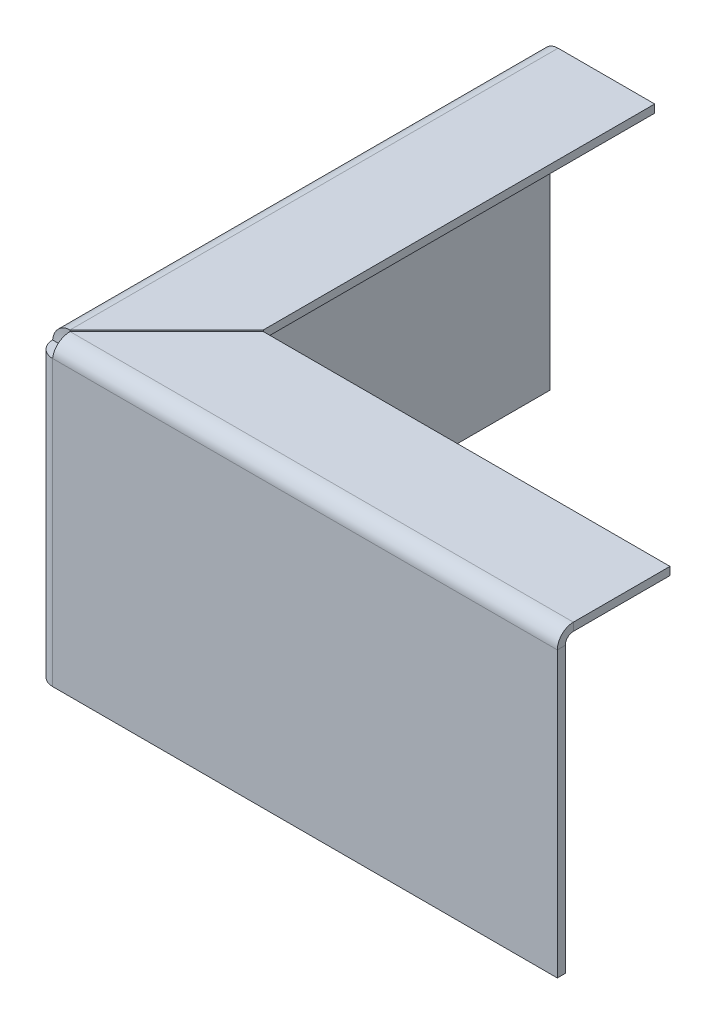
ISO-10303-21;
HEADER;
FILE_DESCRIPTION(('STEP AP214'),'2;1');
FILE_NAME('part.step','',(''),(''),'','','');
FILE_SCHEMA(('AUTOMOTIVE_DESIGN { 1 0 10303 214 1 1 1 1 }'));
ENDSEC;
DATA;
#1=APPLICATION_CONTEXT('core data for automotive mechanical design processes');
#2=APPLICATION_PROTOCOL_DEFINITION('international standard','automotive_design',2000,#1);
#3=PRODUCT_CONTEXT('',#1,'mechanical');
#4=PRODUCT('Part','Part','',(#3));
#5=PRODUCT_RELATED_PRODUCT_CATEGORY('part','',(#4));
#6=PRODUCT_DEFINITION_FORMATION('','',#4);
#7=PRODUCT_DEFINITION_CONTEXT('part definition',#1,'design');
#8=PRODUCT_DEFINITION('design','',#6,#7);
#9=PRODUCT_DEFINITION_SHAPE('','',#8);
#10=(LENGTH_UNIT() NAMED_UNIT(*) SI_UNIT(.MILLI.,.METRE.));
#11=(NAMED_UNIT(*) PLANE_ANGLE_UNIT() SI_UNIT($,.RADIAN.));
#12=(NAMED_UNIT(*) SI_UNIT($,.STERADIAN.) SOLID_ANGLE_UNIT());
#13=UNCERTAINTY_MEASURE_WITH_UNIT(LENGTH_MEASURE(1.E-05),#10,'distance_accuracy_value','');
#14=(GEOMETRIC_REPRESENTATION_CONTEXT(3) GLOBAL_UNCERTAINTY_ASSIGNED_CONTEXT((#13)) GLOBAL_UNIT_ASSIGNED_CONTEXT((#10,
#11,#12)) REPRESENTATION_CONTEXT('',''));
#15=CARTESIAN_POINT('',(0.,0.,0.));
#16=DIRECTION('',(0.,0.,1.));
#17=DIRECTION('',(1.,0.,0.));
#18=AXIS2_PLACEMENT_3D('',#15,#16,#17);
#19=CARTESIAN_POINT('',(0.,37.5,0.));
#20=DIRECTION('',(0.,0.,-1.));
#21=DIRECTION('',(-1.,0.,0.));
#22=AXIS2_PLACEMENT_3D('',#19,#20,#21);
#23=PLANE('',#22);
#24=DIRECTION('',(-1.,0.,0.));
#25=VECTOR('',#24,1.);
#26=CARTESIAN_POINT('',(380.322506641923,35.5000000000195,0.));
#27=LINE('',#26,#25);
#28=CARTESIAN_POINT('',(65.0537511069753,35.5000000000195,0.));
#29=VERTEX_POINT('',#28);
#30=CARTESIAN_POINT('',(2.,35.5000000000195,0.));
#31=VERTEX_POINT('',#30);
#32=EDGE_CURVE('E226',#29,#31,#27,.T.);
#33=ORIENTED_EDGE('',*,*,#32,.T.);
#34=DIRECTION('',(0.,-1.,0.));
#35=VECTOR('',#34,1.);
#36=CARTESIAN_POINT('',(2.,37.5,0.));
#37=LINE('',#36,#35);
#38=CARTESIAN_POINT('',(2.,0.,0.));
#39=VERTEX_POINT('',#38);
#40=EDGE_CURVE('E50',#31,#39,#37,.T.);
#41=ORIENTED_EDGE('',*,*,#40,.T.);
#42=DIRECTION('',(1.,0.,0.));
#43=VECTOR('',#42,1.);
#44=CARTESIAN_POINT('',(0.,0.,0.));
#45=LINE('',#44,#43);
#46=CARTESIAN_POINT('',(65.05375110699,0.,0.));
#47=VERTEX_POINT('',#46);
#48=EDGE_CURVE('E280',#39,#47,#45,.T.);
#49=ORIENTED_EDGE('',*,*,#48,.T.);
#50=DIRECTION('',(0.,-1.,0.));
#51=VECTOR('',#50,1.);
#52=CARTESIAN_POINT('',(65.05375110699,37.5,0.));
#53=LINE('',#52,#51);
#54=EDGE_CURVE('E311',#29,#47,#53,.T.);
#55=ORIENTED_EDGE('',*,*,#54,.F.);
#56=EDGE_LOOP('',(#33,#41,#49,#55));
#57=FACE_BOUND('',#56,.T.);
#58=ADVANCED_FACE('F35',(#57),#23,.F.);
#59=CARTESIAN_POINT('',(65.05375110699,37.5,-1.));
#60=DIRECTION('',(1.,0.,0.));
#61=DIRECTION('',(0.,0.,-1.));
#62=AXIS2_PLACEMENT_3D('',#59,#60,#61);
#63=PLANE('',#62);
#64=DIRECTION('',(0.,-1.,0.));
#65=VECTOR('',#64,1.);
#66=CARTESIAN_POINT('',(65.05375110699,37.5,-1.));
#67=LINE('',#66,#65);
#68=CARTESIAN_POINT('',(65.05375110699,35.5000000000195,-1.));
#69=VERTEX_POINT('',#68);
#70=CARTESIAN_POINT('',(65.05375110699,0.,-1.));
#71=VERTEX_POINT('',#70);
#72=EDGE_CURVE('E309',#69,#71,#67,.T.);
#73=ORIENTED_EDGE('',*,*,#72,.F.);
#74=DIRECTION('',(0.,0.,-1.));
#75=VECTOR('',#74,1.);
#76=CARTESIAN_POINT('',(65.0537511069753,35.5000000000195,0.));
#77=LINE('',#76,#75);
#78=EDGE_CURVE('E245',#29,#69,#77,.T.);
#79=ORIENTED_EDGE('',*,*,#78,.F.);
#80=ORIENTED_EDGE('',*,*,#54,.T.);
#81=DIRECTION('',(0.,0.,1.));
#82=VECTOR('',#81,1.);
#83=CARTESIAN_POINT('',(65.05375110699,0.,-1.));
#84=LINE('',#83,#82);
#85=EDGE_CURVE('E283',#71,#47,#84,.T.);
#86=ORIENTED_EDGE('',*,*,#85,.F.);
#87=EDGE_LOOP('',(#73,#79,#80,#86));
#88=FACE_BOUND('',#87,.T.);
#89=ADVANCED_FACE('F333',(#88),#63,.T.);
#90=CARTESIAN_POINT('',(0.,37.5,-1.));
#91=DIRECTION('',(0.,0.,-1.));
#92=DIRECTION('',(-1.,0.,0.));
#93=AXIS2_PLACEMENT_3D('',#90,#91,#92);
#94=PLANE('',#93);
#95=DIRECTION('',(0.,-1.,0.));
#96=VECTOR('',#95,1.);
#97=CARTESIAN_POINT('',(2.,37.5,-1.));
#98=LINE('',#97,#96);
#99=CARTESIAN_POINT('',(2.,35.5000000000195,-1.));
#100=VERTEX_POINT('',#99);
#101=CARTESIAN_POINT('',(2.,0.,-1.));
#102=VERTEX_POINT('',#101);
#103=EDGE_CURVE('E307',#100,#102,#98,.T.);
#104=ORIENTED_EDGE('',*,*,#103,.F.);
#105=DIRECTION('',(-1.,0.,0.));
#106=VECTOR('',#105,1.);
#107=CARTESIAN_POINT('',(380.322506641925,35.5000000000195,-1.));
#108=LINE('',#107,#106);
#109=EDGE_CURVE('E228',#69,#100,#108,.T.);
#110=ORIENTED_EDGE('',*,*,#109,.F.);
#111=ORIENTED_EDGE('',*,*,#72,.T.);
#112=DIRECTION('',(1.,0.,0.));
#113=VECTOR('',#112,1.);
#114=CARTESIAN_POINT('',(0.,0.,-1.));
#115=LINE('',#114,#113);
#116=EDGE_CURVE('E286',#102,#71,#115,.T.);
#117=ORIENTED_EDGE('',*,*,#116,.F.);
#118=EDGE_LOOP('',(#104,#110,#111,#117));
#119=FACE_BOUND('',#118,.T.);
#120=ADVANCED_FACE('F328',(#119),#94,.T.);
#121=CARTESIAN_POINT('',(2.,37.5,-2.));
#122=DIRECTION('',(0.,-1.,0.));
#123=DIRECTION('',(0.,0.,-1.));
#124=AXIS2_PLACEMENT_3D('',#121,#122,#123);
#125=CYLINDRICAL_SURFACE('',#124,1.);
#126=DIRECTION('',(0.,-1.,0.));
#127=VECTOR('',#126,1.);
#128=CARTESIAN_POINT('',(1.,37.5,-2.));
#129=LINE('',#128,#127);
#130=CARTESIAN_POINT('',(1.,35.5000000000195,-2.));
#131=VERTEX_POINT('',#130);
#132=CARTESIAN_POINT('',(1.,0.,-2.));
#133=VERTEX_POINT('',#132);
#134=EDGE_CURVE('E305',#131,#133,#129,.T.);
#135=ORIENTED_EDGE('',*,*,#134,.F.);
#136=CARTESIAN_POINT('',(2.,35.5000000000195,-2.));
#137=DIRECTION('',(0.,1.,0.));
#138=DIRECTION('',(0.,0.,1.));
#139=AXIS2_PLACEMENT_3D('',#136,#137,#138);
#140=CIRCLE('',#139,1.);
#141=EDGE_CURVE('E164',#131,#100,#140,.T.);
#142=ORIENTED_EDGE('',*,*,#141,.T.);
#143=ORIENTED_EDGE('',*,*,#103,.T.);
#144=CARTESIAN_POINT('',(2.,0.,-2.));
#145=DIRECTION('',(0.,1.,0.));
#146=DIRECTION('',(1.,0.,0.));
#147=AXIS2_PLACEMENT_3D('',#144,#145,#146);
#148=CIRCLE('',#147,1.);
#149=EDGE_CURVE('E289',#133,#102,#148,.T.);
#150=ORIENTED_EDGE('',*,*,#149,.F.);
#151=EDGE_LOOP('',(#135,#142,#143,#150));
#152=FACE_BOUND('',#151,.T.);
#153=ADVANCED_FACE('F321',(#152),#125,.F.);
#154=CARTESIAN_POINT('',(1.,37.5,0.));
#155=DIRECTION('',(1.,0.,0.));
#156=DIRECTION('',(0.,0.,-1.));
#157=AXIS2_PLACEMENT_3D('',#154,#155,#156);
#158=PLANE('',#157);
#159=DIRECTION('',(0.,-1.,0.));
#160=VECTOR('',#159,1.);
#161=CARTESIAN_POINT('',(1.,37.5,-63.1465712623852));
#162=LINE('',#161,#160);
#163=CARTESIAN_POINT('',(1.,35.5000000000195,-63.1465712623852));
#164=VERTEX_POINT('',#163);
#165=CARTESIAN_POINT('',(1.,0.,-63.1465712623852));
#166=VERTEX_POINT('',#165);
#167=EDGE_CURVE('E303',#164,#166,#162,.T.);
#168=ORIENTED_EDGE('',*,*,#167,.F.);
#169=DIRECTION('',(0.,0.,-1.));
#170=VECTOR('',#169,1.);
#171=CARTESIAN_POINT('',(1.,35.5000000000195,-2.00000000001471));
#172=LINE('',#171,#170);
#173=EDGE_CURVE('E192',#131,#164,#172,.T.);
#174=ORIENTED_EDGE('',*,*,#173,.F.);
#175=ORIENTED_EDGE('',*,*,#134,.T.);
#176=DIRECTION('',(0.,0.,-1.));
#177=VECTOR('',#176,1.);
#178=CARTESIAN_POINT('',(1.,0.,0.));
#179=LINE('',#178,#177);
#180=EDGE_CURVE('E292',#166,#133,#179,.F.);
#181=ORIENTED_EDGE('',*,*,#180,.F.);
#182=EDGE_LOOP('',(#168,#174,#175,#181));
#183=FACE_BOUND('',#182,.T.);
#184=ADVANCED_FACE('F361',(#183),#158,.T.);
#185=CARTESIAN_POINT('',(0.,37.5,-63.1465712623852));
#186=DIRECTION('',(0.,0.,-1.));
#187=DIRECTION('',(-1.,0.,0.));
#188=AXIS2_PLACEMENT_3D('',#185,#186,#187);
#189=PLANE('',#188);
#190=DIRECTION('',(0.,-1.,0.));
#191=VECTOR('',#190,1.);
#192=CARTESIAN_POINT('',(0.,37.5,-63.1465712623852));
#193=LINE('',#192,#191);
#194=CARTESIAN_POINT('',(0.,35.5000000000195,-63.1465712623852));
#195=VERTEX_POINT('',#194);
#196=CARTESIAN_POINT('',(0.,0.,-63.1465712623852));
#197=VERTEX_POINT('',#196);
#198=EDGE_CURVE('E157',#195,#197,#193,.T.);
#199=ORIENTED_EDGE('',*,*,#198,.F.);
#200=DIRECTION('',(1.,0.,0.));
#201=VECTOR('',#200,1.);
#202=CARTESIAN_POINT('',(-8.57657896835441E-13,35.5000000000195,-63.1465712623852));
#203=LINE('',#202,#201);
#204=EDGE_CURVE('E177',#195,#164,#203,.T.);
#205=ORIENTED_EDGE('',*,*,#204,.T.);
#206=ORIENTED_EDGE('',*,*,#167,.T.);
#207=DIRECTION('',(1.,0.,0.));
#208=VECTOR('',#207,1.);
#209=CARTESIAN_POINT('',(0.,0.,-63.1465712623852));
#210=LINE('',#209,#208);
#211=EDGE_CURVE('E295',#197,#166,#210,.T.);
#212=ORIENTED_EDGE('',*,*,#211,.F.);
#213=EDGE_LOOP('',(#199,#205,#206,#212));
#214=FACE_BOUND('',#213,.T.);
#215=ADVANCED_FACE('F355',(#214),#189,.T.);
#216=CARTESIAN_POINT('',(0.,37.5,0.));
#217=DIRECTION('',(1.,0.,0.));
#218=DIRECTION('',(0.,0.,-1.));
#219=AXIS2_PLACEMENT_3D('',#216,#217,#218);
#220=PLANE('',#219);
#221=DIRECTION('',(0.,0.,-1.));
#222=VECTOR('',#221,1.);
#223=CARTESIAN_POINT('',(0.,35.5000000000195,-2.00000000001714));
#224=LINE('',#223,#222);
#225=CARTESIAN_POINT('',(0.,35.5000000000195,-2.00000000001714));
#226=VERTEX_POINT('',#225);
#227=EDGE_CURVE('E152',#226,#195,#224,.T.);
#228=ORIENTED_EDGE('',*,*,#227,.T.);
#229=ORIENTED_EDGE('',*,*,#198,.T.);
#230=DIRECTION('',(0.,0.,1.));
#231=VECTOR('',#230,1.);
#232=CARTESIAN_POINT('',(0.,0.,0.));
#233=LINE('',#232,#231);
#234=CARTESIAN_POINT('',(0.,0.,-2.));
#235=VERTEX_POINT('',#234);
#236=EDGE_CURVE('E155',#197,#235,#233,.T.);
#237=ORIENTED_EDGE('',*,*,#236,.T.);
#238=DIRECTION('',(0.,-1.,0.));
#239=VECTOR('',#238,1.);
#240=CARTESIAN_POINT('',(0.,37.5,-2.));
#241=LINE('',#240,#239);
#242=EDGE_CURVE('E58',#226,#235,#241,.T.);
#243=ORIENTED_EDGE('',*,*,#242,.F.);
#244=EDGE_LOOP('',(#228,#229,#237,#243));
#245=FACE_BOUND('',#244,.T.);
#246=ADVANCED_FACE('F150',(#245),#220,.F.);
#247=CARTESIAN_POINT('',(2.,37.5,-2.));
#248=DIRECTION('',(0.,-1.,0.));
#249=DIRECTION('',(0.,0.,-1.));
#250=AXIS2_PLACEMENT_3D('',#247,#248,#249);
#251=CYLINDRICAL_SURFACE('',#250,2.);
#252=CARTESIAN_POINT('',(2.,35.5000000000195,-2.));
#253=DIRECTION('',(0.,-1.,0.));
#254=DIRECTION('',(0.,0.,-1.));
#255=AXIS2_PLACEMENT_3D('',#252,#253,#254);
#256=CIRCLE('',#255,2.);
#257=EDGE_CURVE('E159',#226,#31,#256,.F.);
#258=ORIENTED_EDGE('',*,*,#257,.F.);
#259=ORIENTED_EDGE('',*,*,#242,.T.);
#260=CARTESIAN_POINT('',(2.,0.,-2.));
#261=DIRECTION('',(0.,-1.,0.));
#262=DIRECTION('',(0.,0.,-1.));
#263=AXIS2_PLACEMENT_3D('',#260,#261,#262);
#264=CIRCLE('',#263,2.);
#265=EDGE_CURVE('E299',#235,#39,#264,.F.);
#266=ORIENTED_EDGE('',*,*,#265,.T.);
#267=ORIENTED_EDGE('',*,*,#40,.F.);
#268=EDGE_LOOP('',(#258,#259,#266,#267));
#269=FACE_BOUND('',#268,.T.);
#270=ADVANCED_FACE('F161',(#269),#251,.T.);
#271=CARTESIAN_POINT('',(2.,0.,0.));
#272=DIRECTION('',(0.,-1.,0.));
#273=DIRECTION('',(0.,0.,-1.));
#274=AXIS2_PLACEMENT_3D('',#271,#272,#273);
#275=PLANE('',#274);
#276=DIRECTION('',(0.,0.,-1.));
#277=VECTOR('',#276,1.);
#278=CARTESIAN_POINT('',(2.,0.,0.));
#279=LINE('',#278,#277);
#280=EDGE_CURVE('E11',#39,#102,#279,.T.);
#281=ORIENTED_EDGE('',*,*,#280,.F.);
#282=ORIENTED_EDGE('',*,*,#265,.F.);
#283=DIRECTION('',(-1.,0.,0.));
#284=VECTOR('',#283,1.);
#285=CARTESIAN_POINT('',(1.,0.,-2.));
#286=LINE('',#285,#284);
#287=EDGE_CURVE('E43',#133,#235,#286,.T.);
#288=ORIENTED_EDGE('',*,*,#287,.F.);
#289=ORIENTED_EDGE('',*,*,#149,.T.);
#290=EDGE_LOOP('',(#281,#282,#288,#289));
#291=FACE_BOUND('',#290,.T.);
#292=ADVANCED_FACE('F37',(#291),#275,.T.);
#293=CARTESIAN_POINT('',(1.,0.,-2.));
#294=DIRECTION('',(0.,-1.,0.));
#295=DIRECTION('',(0.,0.,-1.));
#296=AXIS2_PLACEMENT_3D('',#293,#294,#295);
#297=PLANE('',#296);
#298=ORIENTED_EDGE('',*,*,#48,.F.);
#299=ORIENTED_EDGE('',*,*,#280,.T.);
#300=ORIENTED_EDGE('',*,*,#116,.T.);
#301=ORIENTED_EDGE('',*,*,#85,.T.);
#302=EDGE_LOOP('',(#298,#299,#300,#301));
#303=FACE_BOUND('',#302,.T.);
#304=ADVANCED_FACE('F327',(#303),#297,.T.);
#305=CARTESIAN_POINT('',(2.,0.,-2.));
#306=DIRECTION('',(0.,1.,0.));
#307=DIRECTION('',(0.,0.,1.));
#308=AXIS2_PLACEMENT_3D('',#305,#306,#307);
#309=PLANE('',#308);
#310=ORIENTED_EDGE('',*,*,#180,.T.);
#311=ORIENTED_EDGE('',*,*,#287,.T.);
#312=ORIENTED_EDGE('',*,*,#236,.F.);
#313=ORIENTED_EDGE('',*,*,#211,.T.);
#314=EDGE_LOOP('',(#310,#311,#312,#313));
#315=FACE_BOUND('',#314,.T.);
#316=ADVANCED_FACE('F314',(#315),#309,.F.);
#317=CARTESIAN_POINT('',(2.,35.5000000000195,-2.));
#318=DIRECTION('',(0.,1.,0.));
#319=DIRECTION('',(0.,0.,1.));
#320=AXIS2_PLACEMENT_3D('',#317,#318,#319);
#321=PLANE('',#320);
#322=DIRECTION('',(1.,0.,0.));
#323=VECTOR('',#322,1.);
#324=CARTESIAN_POINT('',(0.,35.5000000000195,-2.00000000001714));
#325=LINE('',#324,#323);
#326=EDGE_CURVE('E168',#226,#131,#325,.T.);
#327=ORIENTED_EDGE('',*,*,#326,.F.);
#328=ORIENTED_EDGE('',*,*,#257,.T.);
#329=DIRECTION('',(0.,0.,-1.));
#330=VECTOR('',#329,1.);
#331=CARTESIAN_POINT('',(2.,35.5000000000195,0.));
#332=LINE('',#331,#330);
#333=EDGE_CURVE('E238',#31,#100,#332,.T.);
#334=ORIENTED_EDGE('',*,*,#333,.T.);
#335=ORIENTED_EDGE('',*,*,#141,.F.);
#336=EDGE_LOOP('',(#327,#328,#334,#335));
#337=FACE_BOUND('',#336,.T.);
#338=ADVANCED_FACE('F169',(#337),#321,.T.);
#339=CARTESIAN_POINT('',(65.05375110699,37.5,-14.071220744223));
#340=DIRECTION('',(0.,-1.61498976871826E-12,-1.));
#341=DIRECTION('',(1.,0.,0.));
#342=AXIS2_PLACEMENT_3D('',#339,#340,#341);
#343=PLANE('',#342);
#344=DIRECTION('',(0.,-1.,1.61498976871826E-12));
#345=VECTOR('',#344,1.);
#346=CARTESIAN_POINT('',(14.2479974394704,37.5,-14.071220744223));
#347=LINE('',#346,#345);
#348=CARTESIAN_POINT('',(14.2479974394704,37.5,-14.071220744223));
#349=VERTEX_POINT('',#348);
#350=CARTESIAN_POINT('',(14.2479974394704,36.5,-14.0712207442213));
#351=VERTEX_POINT('',#350);
#352=EDGE_CURVE('E165',#349,#351,#347,.T.);
#353=ORIENTED_EDGE('',*,*,#352,.F.);
#354=DIRECTION('',(1.,0.,0.));
#355=VECTOR('',#354,1.);
#356=CARTESIAN_POINT('',(65.05375110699,37.5,-14.071220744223));
#357=LINE('',#356,#355);
#358=CARTESIAN_POINT('',(65.05375110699,37.5,-14.071220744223));
#359=VERTEX_POINT('',#358);
#360=EDGE_CURVE('E248',#359,#349,#357,.F.);
#361=ORIENTED_EDGE('',*,*,#360,.F.);
#362=DIRECTION('',(0.,-1.,1.61498976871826E-12));
#363=VECTOR('',#362,1.);
#364=CARTESIAN_POINT('',(65.05375110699,37.5,-14.071220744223));
#365=LINE('',#364,#363);
#366=CARTESIAN_POINT('',(65.05375110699,36.5,-14.0712207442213));
#367=VERTEX_POINT('',#366);
#368=EDGE_CURVE('E275',#359,#367,#365,.T.);
#369=ORIENTED_EDGE('',*,*,#368,.T.);
#370=DIRECTION('',(1.,0.,0.));
#371=VECTOR('',#370,1.);
#372=CARTESIAN_POINT('',(65.05375110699,36.5,-14.0712207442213));
#373=LINE('',#372,#371);
#374=EDGE_CURVE('E256',#367,#351,#373,.F.);
#375=ORIENTED_EDGE('',*,*,#374,.T.);
#376=EDGE_LOOP('',(#353,#361,#369,#375));
#377=FACE_BOUND('',#376,.T.);
#378=ADVANCED_FACE('F402',(#377),#343,.T.);
#379=CARTESIAN_POINT('',(65.05375110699,37.5,-14.071220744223));
#380=DIRECTION('',(-1.,0.,0.));
#381=DIRECTION('',(0.,-1.61498976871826E-12,-1.));
#382=AXIS2_PLACEMENT_3D('',#379,#380,#381);
#383=PLANE('',#382);
#384=ORIENTED_EDGE('',*,*,#368,.F.);
#385=DIRECTION('',(0.,-1.61498976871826E-12,-1.));
#386=VECTOR('',#385,1.);
#387=CARTESIAN_POINT('',(65.05375110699,37.5,-14.071220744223));
#388=LINE('',#387,#386);
#389=CARTESIAN_POINT('',(65.0537511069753,37.5000000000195,-2.00000000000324));
#390=VERTEX_POINT('',#389);
#391=EDGE_CURVE('E266',#359,#390,#388,.F.);
#392=ORIENTED_EDGE('',*,*,#391,.T.);
#393=DIRECTION('',(0.,-1.,1.61498976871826E-12));
#394=VECTOR('',#393,1.);
#395=CARTESIAN_POINT('',(65.0537511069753,37.5000000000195,-2.00000000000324));
#396=LINE('',#395,#394);
#397=CARTESIAN_POINT('',(65.0537511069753,36.5000000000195,-2.00000000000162));
#398=VERTEX_POINT('',#397);
#399=EDGE_CURVE('E273',#390,#398,#396,.T.);
#400=ORIENTED_EDGE('',*,*,#399,.T.);
#401=DIRECTION('',(0.,-1.61498976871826E-12,-1.));
#402=VECTOR('',#401,1.);
#403=CARTESIAN_POINT('',(65.05375110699,36.5,-14.0712207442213));
#404=LINE('',#403,#402);
#405=EDGE_CURVE('E253',#367,#398,#404,.F.);
#406=ORIENTED_EDGE('',*,*,#405,.F.);
#407=EDGE_LOOP('',(#384,#392,#400,#406));
#408=FACE_BOUND('',#407,.T.);
#409=ADVANCED_FACE('F412',(#408),#383,.F.);
#410=CARTESIAN_POINT('',(39.6508742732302,37.499999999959,-39.4740975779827));
#411=DIRECTION('',(-0.707106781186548,-1.14197021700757E-12,-0.707106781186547));
#412=DIRECTION('',(0.707106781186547,-1.14197021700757E-12,-0.707106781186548));
#413=AXIS2_PLACEMENT_3D('',#410,#411,#412);
#414=PLANE('',#413);
#415=DIRECTION('',(0.707106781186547,-1.14197021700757E-12,-0.707106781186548));
#416=VECTOR('',#415,1.);
#417=CARTESIAN_POINT('',(39.6508742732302,37.499999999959,-39.4740975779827));
#418=LINE('',#417,#416);
#419=CARTESIAN_POINT('',(2.17677669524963,37.5000000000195,-2.00000000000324));
#420=VERTEX_POINT('',#419);
#421=EDGE_CURVE('E259',#420,#349,#418,.T.);
#422=ORIENTED_EDGE('',*,*,#421,.T.);
#423=ORIENTED_EDGE('',*,*,#352,.T.);
#424=DIRECTION('',(0.707106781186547,-1.14197021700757E-12,-0.707106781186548));
#425=VECTOR('',#424,1.);
#426=CARTESIAN_POINT('',(39.6508742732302,36.499999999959,-39.4740975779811));
#427=LINE('',#426,#425);
#428=CARTESIAN_POINT('',(2.17677669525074,36.5000000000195,-2.00000000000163));
#429=VERTEX_POINT('',#428);
#430=EDGE_CURVE('E252',#429,#351,#427,.T.);
#431=ORIENTED_EDGE('',*,*,#430,.F.);
#432=DIRECTION('',(0.,-1.,1.61498976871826E-12));
#433=VECTOR('',#432,1.);
#434=CARTESIAN_POINT('',(2.17677669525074,37.5000000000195,-2.00000000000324));
#435=LINE('',#434,#433);
#436=EDGE_CURVE('E262',#420,#429,#435,.T.);
#437=ORIENTED_EDGE('',*,*,#436,.F.);
#438=EDGE_LOOP('',(#422,#423,#431,#437));
#439=FACE_BOUND('',#438,.T.);
#440=ADVANCED_FACE('F424',(#439),#414,.T.);
#441=CARTESIAN_POINT('',(65.05375110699,36.5,-14.0712207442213));
#442=DIRECTION('',(0.,-1.,1.61498976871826E-12));
#443=DIRECTION('',(0.,-1.61498976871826E-12,-1.));
#444=AXIS2_PLACEMENT_3D('',#441,#442,#443);
#445=PLANE('',#444);
#446=DIRECTION('',(1.,0.,0.));
#447=VECTOR('',#446,1.);
#448=CARTESIAN_POINT('',(65.05375110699,36.5000000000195,-2.00000000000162));
#449=LINE('',#448,#447);
#450=EDGE_CURVE('E250',#398,#429,#449,.F.);
#451=ORIENTED_EDGE('',*,*,#450,.T.);
#452=ORIENTED_EDGE('',*,*,#430,.T.);
#453=ORIENTED_EDGE('',*,*,#374,.F.);
#454=ORIENTED_EDGE('',*,*,#405,.T.);
#455=EDGE_LOOP('',(#451,#452,#453,#454));
#456=FACE_BOUND('',#455,.T.);
#457=ADVANCED_FACE('F427',(#456),#445,.T.);
#458=CARTESIAN_POINT('',(65.05375110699,37.5,-14.071220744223));
#459=DIRECTION('',(0.,-1.,1.61498976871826E-12));
#460=DIRECTION('',(0.,-1.61498976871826E-12,-1.));
#461=AXIS2_PLACEMENT_3D('',#458,#459,#460);
#462=PLANE('',#461);
#463=DIRECTION('',(1.,0.,0.));
#464=VECTOR('',#463,1.);
#465=CARTESIAN_POINT('',(65.05375110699,37.5000000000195,-2.00000000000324));
#466=LINE('',#465,#464);
#467=EDGE_CURVE('E263',#390,#420,#466,.F.);
#468=ORIENTED_EDGE('',*,*,#467,.F.);
#469=ORIENTED_EDGE('',*,*,#391,.F.);
#470=ORIENTED_EDGE('',*,*,#360,.T.);
#471=ORIENTED_EDGE('',*,*,#421,.F.);
#472=EDGE_LOOP('',(#468,#469,#470,#471));
#473=FACE_BOUND('',#472,.T.);
#474=ADVANCED_FACE('F438',(#473),#462,.F.);
#475=CARTESIAN_POINT('',(65.0537511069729,35.5000000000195,-2.));
#476=DIRECTION('',(-1.,1.22124532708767E-12,0.));
#477=DIRECTION('',(-1.22124532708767E-12,-1.,0.));
#478=AXIS2_PLACEMENT_3D('',#475,#476,#477);
#479=PLANE('',#478);
#480=ORIENTED_EDGE('',*,*,#399,.F.);
#481=CARTESIAN_POINT('',(65.0537511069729,35.5000000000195,-2.));
#482=DIRECTION('',(1.,-1.22124532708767E-12,0.));
#483=DIRECTION('',(1.22124532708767E-12,1.,0.));
#484=AXIS2_PLACEMENT_3D('',#481,#482,#483);
#485=CIRCLE('',#484,2.);
#486=EDGE_CURVE('E240',#390,#29,#485,.T.);
#487=ORIENTED_EDGE('',*,*,#486,.T.);
#488=ORIENTED_EDGE('',*,*,#78,.T.);
#489=CARTESIAN_POINT('',(65.0537511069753,35.5000000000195,-2.));
#490=DIRECTION('',(-1.,0.,0.));
#491=DIRECTION('',(0.,0.,1.));
#492=AXIS2_PLACEMENT_3D('',#489,#490,#491);
#493=CIRCLE('',#492,1.);
#494=EDGE_CURVE('E231',#398,#69,#493,.F.);
#495=ORIENTED_EDGE('',*,*,#494,.F.);
#496=EDGE_LOOP('',(#480,#487,#488,#495));
#497=FACE_BOUND('',#496,.T.);
#498=ADVANCED_FACE('F457',(#497),#479,.F.);
#499=CARTESIAN_POINT('',(1.82322330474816,34.5000000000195,-2.));
#500=CARTESIAN_POINT('',(1.82322330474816,34.1666666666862,-2.));
#501=CARTESIAN_POINT('',(1.82322330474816,33.8333333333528,-2.));
#502=CARTESIAN_POINT('',(1.82322330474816,33.5000000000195,-2.));
#503=CARTESIAN_POINT('',(1.82322330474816,34.5000000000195,0.));
#504=CARTESIAN_POINT('',(1.82322330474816,34.1666666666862,0.666666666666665));
#505=CARTESIAN_POINT('',(1.82322330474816,33.8333333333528,1.33333333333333));
#506=CARTESIAN_POINT('',(1.82322330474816,33.5000000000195,2.));
#507=CARTESIAN_POINT('',(2.17677669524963,36.5000000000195,0.));
#508=CARTESIAN_POINT('',(2.17677669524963,36.8333333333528,0.666666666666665));
#509=CARTESIAN_POINT('',(2.17677669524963,37.1666666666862,1.33333333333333));
#510=CARTESIAN_POINT('',(2.17677669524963,37.5000000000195,2.));
#511=CARTESIAN_POINT('',(2.17677669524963,36.5000000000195,-2.));
#512=CARTESIAN_POINT('',(2.17677669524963,36.8333333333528,-2.));
#513=CARTESIAN_POINT('',(2.17677669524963,37.1666666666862,-2.));
#514=CARTESIAN_POINT('',(2.17677669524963,37.5000000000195,-2.));
#515=CARTESIAN_POINT('',(2.17677669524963,36.5000000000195,-4.));
#516=CARTESIAN_POINT('',(2.17677669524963,36.8333333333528,-4.66666666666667));
#517=CARTESIAN_POINT('',(2.17677669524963,37.1666666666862,-5.33333333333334));
#518=CARTESIAN_POINT('',(2.17677669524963,37.5000000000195,-6.));
#519=CARTESIAN_POINT('',(1.82322330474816,34.5000000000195,-4.));
#520=CARTESIAN_POINT('',(1.82322330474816,34.1666666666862,-4.66666666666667));
#521=CARTESIAN_POINT('',(1.82322330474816,33.8333333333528,-5.33333333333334));
#522=CARTESIAN_POINT('',(1.82322330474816,33.5000000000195,-6.));
#523=CARTESIAN_POINT('',(1.82322330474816,34.5000000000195,-2.));
#524=CARTESIAN_POINT('',(1.82322330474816,34.1666666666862,-2.));
#525=CARTESIAN_POINT('',(1.82322330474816,33.8333333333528,-2.));
#526=CARTESIAN_POINT('',(1.82322330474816,33.5000000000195,-2.));
#527=(BOUNDED_SURFACE() B_SPLINE_SURFACE(3,3,((#499,#500,#501,#502),(#503,#504,#505,#506),(#507,
#508,#509,#510),(#511,#512,#513,#514),(#515,#516,#517,#518),(#519,#520,#521,#522),(#523,#524,
#525,#526)),.UNSPECIFIED.,.T.,.F.,.F.) B_SPLINE_SURFACE_WITH_KNOTS((4,3,4),(4,4),(0.,0.5,1.),
(0.,1.),.UNSPECIFIED.) GEOMETRIC_REPRESENTATION_ITEM() RATIONAL_B_SPLINE_SURFACE(((1.,1.,1.,1.),
(0.333333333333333,0.333333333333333,0.333333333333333,0.333333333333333),(0.333333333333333,
0.333333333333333,0.333333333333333,0.333333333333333),(1.,1.,1.,1.),(0.333333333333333,
0.333333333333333,0.333333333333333,0.333333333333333),(0.333333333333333,0.333333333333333,
0.333333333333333,0.333333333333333),(1.,1.,1.,1.))) REPRESENTATION_ITEM('') SURFACE());
#528=CARTESIAN_POINT('',(1.99999999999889,35.5000000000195,-2.));
#529=DIRECTION('',(-0.99611649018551,0.0880450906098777,0.));
#530=DIRECTION('',(-0.0880450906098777,-0.99611649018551,0.));
#531=AXIS2_PLACEMENT_3D('',#528,#529,#530);
#532=ELLIPSE('',#531,2.00779730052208,2.);
#533=EDGE_CURVE('E232',#31,#420,#532,.T.);
#534=CARTESIAN_POINT('',(1.99999999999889,35.5000000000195,-2.));
#535=DIRECTION('',(-0.98473192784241,0.174077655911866,0.));
#536=DIRECTION('',(-0.174077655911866,-0.98473192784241,0.));
#537=AXIS2_PLACEMENT_3D('',#534,#535,#536);
#538=ELLIPSE('',#537,1.01550480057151,1.);
#539=EDGE_CURVE('E235',#100,#429,#538,.T.);
#540=ORIENTED_EDGE('',*,*,#533,.T.);
#541=ORIENTED_EDGE('',*,*,#436,.T.);
#542=ORIENTED_EDGE('',*,*,#539,.F.);
#543=ORIENTED_EDGE('',*,*,#333,.F.);
#544=EDGE_LOOP('',(#540,#541,#542,#543));
#545=FACE_BOUND('',#544,.T.);
#546=ADVANCED_FACE('F468',(#545),#527,.F.);
#547=CARTESIAN_POINT('',(380.322506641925,35.5000000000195,-2.));
#548=DIRECTION('',(-1.,0.,0.));
#549=DIRECTION('',(0.,0.,1.));
#550=AXIS2_PLACEMENT_3D('',#547,#548,#549);
#551=CYLINDRICAL_SURFACE('',#550,1.);
#552=ORIENTED_EDGE('',*,*,#109,.T.);
#553=ORIENTED_EDGE('',*,*,#539,.T.);
#554=ORIENTED_EDGE('',*,*,#450,.F.);
#555=ORIENTED_EDGE('',*,*,#494,.T.);
#556=EDGE_LOOP('',(#552,#553,#554,#555));
#557=FACE_BOUND('',#556,.T.);
#558=ADVANCED_FACE('F471',(#557),#551,.F.);
#559=CARTESIAN_POINT('',(380.322506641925,35.5000000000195,-2.));
#560=DIRECTION('',(-1.,0.,0.));
#561=DIRECTION('',(0.,0.,1.));
#562=AXIS2_PLACEMENT_3D('',#559,#560,#561);
#563=CYLINDRICAL_SURFACE('',#562,2.);
#564=ORIENTED_EDGE('',*,*,#32,.F.);
#565=ORIENTED_EDGE('',*,*,#486,.F.);
#566=ORIENTED_EDGE('',*,*,#467,.T.);
#567=ORIENTED_EDGE('',*,*,#533,.F.);
#568=EDGE_LOOP('',(#564,#565,#566,#567));
#569=FACE_BOUND('',#568,.T.);
#570=ADVANCED_FACE('F482',(#569),#563,.T.);
#571=CARTESIAN_POINT('',(14.0712207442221,37.5,-63.1465712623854));
#572=DIRECTION('',(0.,0.,-1.));
#573=DIRECTION('',(1.,-1.61498976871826E-12,0.));
#574=AXIS2_PLACEMENT_3D('',#571,#572,#573);
#575=PLANE('',#574);
#576=DIRECTION('',(-1.61498976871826E-12,-1.,0.));
#577=VECTOR('',#576,1.);
#578=CARTESIAN_POINT('',(2.00000000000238,37.5000000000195,-63.1465712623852));
#579=LINE('',#578,#577);
#580=CARTESIAN_POINT('',(2.00000000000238,37.5000000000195,-63.1465712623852));
#581=VERTEX_POINT('',#580);
#582=CARTESIAN_POINT('',(2.00000000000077,36.5000000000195,-63.1465712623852));
#583=VERTEX_POINT('',#582);
#584=EDGE_CURVE('E222',#581,#583,#579,.T.);
#585=ORIENTED_EDGE('',*,*,#584,.F.);
#586=DIRECTION('',(1.,-1.61498976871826E-12,0.));
#587=VECTOR('',#586,1.);
#588=CARTESIAN_POINT('',(14.0712207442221,37.5,-63.1465712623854));
#589=LINE('',#588,#587);
#590=CARTESIAN_POINT('',(14.0712207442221,37.5,-63.1465712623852));
#591=VERTEX_POINT('',#590);
#592=EDGE_CURVE('E214',#581,#591,#589,.T.);
#593=ORIENTED_EDGE('',*,*,#592,.T.);
#594=DIRECTION('',(-1.61498976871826E-12,-1.,0.));
#595=VECTOR('',#594,1.);
#596=CARTESIAN_POINT('',(14.0712207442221,37.5,-63.1465712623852));
#597=LINE('',#596,#595);
#598=CARTESIAN_POINT('',(14.0712207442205,36.5,-63.1465712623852));
#599=VERTEX_POINT('',#598);
#600=EDGE_CURVE('E220',#591,#599,#597,.T.);
#601=ORIENTED_EDGE('',*,*,#600,.T.);
#602=DIRECTION('',(1.,-1.61498976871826E-12,0.));
#603=VECTOR('',#602,1.);
#604=CARTESIAN_POINT('',(14.0712207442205,36.5,-63.1465712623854));
#605=LINE('',#604,#603);
#606=EDGE_CURVE('E203',#583,#599,#605,.T.);
#607=ORIENTED_EDGE('',*,*,#606,.F.);
#608=EDGE_LOOP('',(#585,#593,#601,#607));
#609=FACE_BOUND('',#608,.T.);
#610=ADVANCED_FACE('F501',(#609),#575,.T.);
#611=CARTESIAN_POINT('',(14.071220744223,37.5,-2.00000000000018));
#612=DIRECTION('',(1.,-1.61498976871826E-12,0.));
#613=DIRECTION('',(0.,0.,1.));
#614=AXIS2_PLACEMENT_3D('',#611,#612,#613);
#615=PLANE('',#614);
#616=ORIENTED_EDGE('',*,*,#600,.F.);
#617=DIRECTION('',(0.,0.,1.));
#618=VECTOR('',#617,1.);
#619=CARTESIAN_POINT('',(14.071220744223,37.5,-2.00000000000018));
#620=LINE('',#619,#618);
#621=CARTESIAN_POINT('',(14.0712207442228,37.5,-14.2479974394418));
#622=VERTEX_POINT('',#621);
#623=EDGE_CURVE('E176',#622,#591,#620,.F.);
#624=ORIENTED_EDGE('',*,*,#623,.F.);
#625=DIRECTION('',(-1.61498976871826E-12,-1.,0.));
#626=VECTOR('',#625,1.);
#627=CARTESIAN_POINT('',(14.0712207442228,37.5,-14.2479974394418));
#628=LINE('',#627,#626);
#629=CARTESIAN_POINT('',(14.0712207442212,36.5,-14.2479974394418));
#630=VERTEX_POINT('',#629);
#631=EDGE_CURVE('E210',#622,#630,#628,.T.);
#632=ORIENTED_EDGE('',*,*,#631,.T.);
#633=DIRECTION('',(0.,0.,1.));
#634=VECTOR('',#633,1.);
#635=CARTESIAN_POINT('',(14.0712207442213,36.5,-2.00000000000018));
#636=LINE('',#635,#634);
#637=EDGE_CURVE('E198',#630,#599,#636,.F.);
#638=ORIENTED_EDGE('',*,*,#637,.T.);
#639=EDGE_LOOP('',(#616,#624,#632,#638));
#640=FACE_BOUND('',#639,.T.);
#641=ADVANCED_FACE('F512',(#640),#615,.T.);
#642=CARTESIAN_POINT('',(7.94722202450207,37.5000000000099,-8.12399871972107));
#643=DIRECTION('',(0.707106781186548,-1.14197021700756E-12,0.707106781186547));
#644=DIRECTION('',(-0.707106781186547,1.14197021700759E-12,0.707106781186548));
#645=AXIS2_PLACEMENT_3D('',#642,#643,#644);
#646=PLANE('',#645);
#647=DIRECTION('',(-0.707106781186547,1.14197021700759E-12,0.707106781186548));
#648=VECTOR('',#647,1.);
#649=CARTESIAN_POINT('',(7.94722202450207,37.5000000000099,-8.12399871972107));
#650=LINE('',#649,#648);
#651=CARTESIAN_POINT('',(2.00000000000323,37.5000000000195,-2.17677669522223));
#652=VERTEX_POINT('',#651);
#653=EDGE_CURVE('E202',#622,#652,#650,.T.);
#654=ORIENTED_EDGE('',*,*,#653,.T.);
#655=DIRECTION('',(-1.61498976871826E-12,-1.,0.));
#656=VECTOR('',#655,1.);
#657=CARTESIAN_POINT('',(2.00000000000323,37.5000000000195,-2.17677669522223));
#658=LINE('',#657,#656);
#659=CARTESIAN_POINT('',(2.00000000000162,36.5000000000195,-2.17677669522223));
#660=VERTEX_POINT('',#659);
#661=EDGE_CURVE('E190',#652,#660,#658,.T.);
#662=ORIENTED_EDGE('',*,*,#661,.T.);
#663=DIRECTION('',(-0.707106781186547,1.14197021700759E-12,0.707106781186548));
#664=VECTOR('',#663,1.);
#665=CARTESIAN_POINT('',(7.94722202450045,36.5000000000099,-8.12399871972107));
#666=LINE('',#665,#664);
#667=EDGE_CURVE('E206',#630,#660,#666,.T.);
#668=ORIENTED_EDGE('',*,*,#667,.F.);
#669=ORIENTED_EDGE('',*,*,#631,.F.);
#670=EDGE_LOOP('',(#654,#662,#668,#669));
#671=FACE_BOUND('',#670,.T.);
#672=ADVANCED_FACE('F523',(#671),#646,.T.);
#673=CARTESIAN_POINT('',(14.0712207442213,36.5,-2.00000000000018));
#674=DIRECTION('',(-1.61498976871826E-12,-1.,0.));
#675=DIRECTION('',(1.,-1.61498976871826E-12,0.));
#676=AXIS2_PLACEMENT_3D('',#673,#674,#675);
#677=PLANE('',#676);
#678=ORIENTED_EDGE('',*,*,#637,.F.);
#679=ORIENTED_EDGE('',*,*,#667,.T.);
#680=DIRECTION('',(0.,0.,1.));
#681=VECTOR('',#680,1.);
#682=CARTESIAN_POINT('',(2.00000000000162,36.5000000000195,-2.00000000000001));
#683=LINE('',#682,#681);
#684=EDGE_CURVE('E201',#660,#583,#683,.F.);
#685=ORIENTED_EDGE('',*,*,#684,.T.);
#686=ORIENTED_EDGE('',*,*,#606,.T.);
#687=EDGE_LOOP('',(#678,#679,#685,#686));
#688=FACE_BOUND('',#687,.T.);
#689=ADVANCED_FACE('F526',(#688),#677,.T.);
#690=CARTESIAN_POINT('',(14.071220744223,37.5,-2.00000000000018));
#691=DIRECTION('',(-1.61498976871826E-12,-1.,0.));
#692=DIRECTION('',(1.,-1.61498976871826E-12,0.));
#693=AXIS2_PLACEMENT_3D('',#690,#691,#692);
#694=PLANE('',#693);
#695=ORIENTED_EDGE('',*,*,#623,.T.);
#696=ORIENTED_EDGE('',*,*,#592,.F.);
#697=DIRECTION('',(0.,0.,1.));
#698=VECTOR('',#697,1.);
#699=CARTESIAN_POINT('',(2.00000000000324,37.5000000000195,-2.00000000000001));
#700=LINE('',#699,#698);
#701=EDGE_CURVE('E213',#652,#581,#700,.F.);
#702=ORIENTED_EDGE('',*,*,#701,.F.);
#703=ORIENTED_EDGE('',*,*,#653,.F.);
#704=EDGE_LOOP('',(#695,#696,#702,#703));
#705=FACE_BOUND('',#704,.T.);
#706=ADVANCED_FACE('F537',(#705),#694,.F.);
#707=CARTESIAN_POINT('',(1.99999999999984,36.5000000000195,-2.17677669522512));
#708=CARTESIAN_POINT('',(1.99999999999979,36.8333333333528,-2.17677669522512));
#709=CARTESIAN_POINT('',(1.99999999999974,37.1666666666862,-2.17677669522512));
#710=CARTESIAN_POINT('',(1.99999999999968,37.5000000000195,-2.17677669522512));
#711=CARTESIAN_POINT('',(-1.58293517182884E-13,36.5000000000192,-2.17677669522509));
#712=CARTESIAN_POINT('',(-0.666666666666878,36.8333333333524,-2.17677669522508));
#713=CARTESIAN_POINT('',(-1.3333333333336,37.1666666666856,-2.17677669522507));
#714=CARTESIAN_POINT('',(-2.00000000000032,37.5000000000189,-2.17677669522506));
#715=CARTESIAN_POINT('',(1.63497687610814E-13,34.5000000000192,-1.82322330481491));
#716=CARTESIAN_POINT('',(-0.666666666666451,34.1666666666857,-1.8232233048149));
#717=CARTESIAN_POINT('',(-1.33333333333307,33.8333333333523,-1.82322330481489));
#718=CARTESIAN_POINT('',(-1.99999999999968,33.5000000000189,-1.82322330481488));
#719=CARTESIAN_POINT('',(2.00000000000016,34.5000000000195,-1.82322330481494));
#720=CARTESIAN_POINT('',(2.00000000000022,34.1666666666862,-1.82322330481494));
#721=CARTESIAN_POINT('',(2.00000000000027,33.8333333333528,-1.82322330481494));
#722=CARTESIAN_POINT('',(2.00000000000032,33.5000000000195,-1.82322330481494));
#723=CARTESIAN_POINT('',(4.00000000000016,34.5000000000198,-1.82322330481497));
#724=CARTESIAN_POINT('',(4.66666666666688,34.1666666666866,-1.82322330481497));
#725=CARTESIAN_POINT('',(5.3333333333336,33.8333333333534,-1.82322330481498));
#726=CARTESIAN_POINT('',(6.00000000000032,33.5000000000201,-1.82322330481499));
#727=CARTESIAN_POINT('',(3.99999999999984,36.5000000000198,-2.17677669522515));
#728=CARTESIAN_POINT('',(4.66666666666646,36.8333333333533,-2.17677669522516));
#729=CARTESIAN_POINT('',(5.33333333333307,37.1666666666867,-2.17677669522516));
#730=CARTESIAN_POINT('',(5.99999999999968,37.5000000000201,-2.17677669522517));
#731=CARTESIAN_POINT('',(1.99999999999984,36.5000000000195,-2.17677669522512));
#732=CARTESIAN_POINT('',(1.99999999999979,36.8333333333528,-2.17677669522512));
#733=CARTESIAN_POINT('',(1.99999999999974,37.1666666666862,-2.17677669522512));
#734=CARTESIAN_POINT('',(1.99999999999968,37.5000000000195,-2.17677669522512));
#735=(BOUNDED_SURFACE() B_SPLINE_SURFACE(3,3,((#707,#708,#709,#710),(#711,#712,#713,#714),(#715,
#716,#717,#718),(#719,#720,#721,#722),(#723,#724,#725,#726),(#727,#728,#729,#730),(#731,#732,
#733,#734)),.UNSPECIFIED.,.T.,.F.,.F.) B_SPLINE_SURFACE_WITH_KNOTS((4,3,4),(4,4),(0.,0.5,1.),
(0.,1.),.UNSPECIFIED.) GEOMETRIC_REPRESENTATION_ITEM() RATIONAL_B_SPLINE_SURFACE(((1.,1.,1.,1.),
(0.333333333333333,0.333333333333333,0.333333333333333,0.333333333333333),(0.333333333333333,
0.333333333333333,0.333333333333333,0.333333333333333),(1.,1.,1.,1.),(0.333333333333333,
0.333333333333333,0.333333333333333,0.333333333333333),(0.333333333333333,0.333333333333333,
0.333333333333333,0.333333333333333),(1.,1.,1.,1.))) REPRESENTATION_ITEM('') SURFACE());
#736=CARTESIAN_POINT('',(2.,35.5000000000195,-2.00000000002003));
#737=DIRECTION('',(0.,0.0880450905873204,0.996116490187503));
#738=DIRECTION('',(-1.58967619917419E-13,0.996116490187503,-0.0880450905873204));
#739=AXIS2_PLACEMENT_3D('',#736,#737,#738);
#740=ELLIPSE('',#739,2.00779730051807,2.);
#741=EDGE_CURVE('E184',#652,#226,#740,.T.);
#742=CARTESIAN_POINT('',(2.,35.5000000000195,-2.00000000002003));
#743=DIRECTION('',(0.,0.174077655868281,0.984731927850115));
#744=DIRECTION('',(-1.58439036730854E-13,0.984731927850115,-0.174077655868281));
#745=AXIS2_PLACEMENT_3D('',#742,#743,#744);
#746=ELLIPSE('',#745,1.01550480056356,1.);
#747=EDGE_CURVE('E692',#660,#131,#746,.T.);
#748=ORIENTED_EDGE('',*,*,#661,.F.);
#749=ORIENTED_EDGE('',*,*,#741,.T.);
#750=ORIENTED_EDGE('',*,*,#326,.T.);
#751=ORIENTED_EDGE('',*,*,#747,.F.);
#752=EDGE_LOOP('',(#748,#749,#750,#751));
#753=FACE_BOUND('',#752,.T.);
#754=ADVANCED_FACE('F189',(#753),#735,.F.);
#755=CARTESIAN_POINT('',(1.99999999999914,35.5000000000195,-63.1465712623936));
#756=DIRECTION('',(0.,-4.17721413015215E-12,1.));
#757=DIRECTION('',(0.,-1.,-4.17721413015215E-12));
#758=AXIS2_PLACEMENT_3D('',#755,#756,#757);
#759=PLANE('',#758);
#760=CARTESIAN_POINT('',(1.99999999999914,35.5000000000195,-63.1465712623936));
#761=DIRECTION('',(0.,4.17721413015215E-12,-1.));
#762=DIRECTION('',(0.,1.,4.17721413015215E-12));
#763=AXIS2_PLACEMENT_3D('',#760,#761,#762);
#764=CIRCLE('',#763,2.);
#765=EDGE_CURVE('E186',#195,#581,#764,.T.);
#766=ORIENTED_EDGE('',*,*,#765,.T.);
#767=ORIENTED_EDGE('',*,*,#584,.T.);
#768=CARTESIAN_POINT('',(1.99999999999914,35.5000000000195,-63.1465712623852));
#769=DIRECTION('',(0.,0.,-1.));
#770=DIRECTION('',(-1.,0.,0.));
#771=AXIS2_PLACEMENT_3D('',#768,#769,#770);
#772=CIRCLE('',#771,1.);
#773=EDGE_CURVE('E197',#164,#583,#772,.T.);
#774=ORIENTED_EDGE('',*,*,#773,.F.);
#775=ORIENTED_EDGE('',*,*,#204,.F.);
#776=EDGE_LOOP('',(#766,#767,#774,#775));
#777=FACE_BOUND('',#776,.T.);
#778=ADVANCED_FACE('F566',(#777),#759,.F.);
#779=CARTESIAN_POINT('',(2.,35.5000000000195,-2.00000000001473));
#780=DIRECTION('',(0.,0.,-1.));
#781=DIRECTION('',(-1.,0.,0.));
#782=AXIS2_PLACEMENT_3D('',#779,#780,#781);
#783=CYLINDRICAL_SURFACE('',#782,1.);
#784=ORIENTED_EDGE('',*,*,#173,.T.);
#785=ORIENTED_EDGE('',*,*,#773,.T.);
#786=ORIENTED_EDGE('',*,*,#684,.F.);
#787=ORIENTED_EDGE('',*,*,#747,.T.);
#788=EDGE_LOOP('',(#784,#785,#786,#787));
#789=FACE_BOUND('',#788,.T.);
#790=ADVANCED_FACE('F568',(#789),#783,.F.);
#791=CARTESIAN_POINT('',(2.,35.5000000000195,-2.00000000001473));
#792=DIRECTION('',(0.,0.,-1.));
#793=DIRECTION('',(-1.,0.,0.));
#794=AXIS2_PLACEMENT_3D('',#791,#792,#793);
#795=CYLINDRICAL_SURFACE('',#794,2.);
#796=ORIENTED_EDGE('',*,*,#227,.F.);
#797=ORIENTED_EDGE('',*,*,#741,.F.);
#798=ORIENTED_EDGE('',*,*,#701,.T.);
#799=ORIENTED_EDGE('',*,*,#765,.F.);
#800=EDGE_LOOP('',(#796,#797,#798,#799));
#801=FACE_BOUND('',#800,.T.);
#802=ADVANCED_FACE('F182',(#801),#795,.T.);
#803=CLOSED_SHELL('',(#58,#89,#120,#153,#184,#215,#246,#270,#292,#304,#316,#338,#378,#409,#440,
#457,#474,#498,#546,#558,#570,#610,#641,#672,#689,#706,#754,#778,#790,#802));
#804=MANIFOLD_SOLID_BREP('B2',#803);
#805=ADVANCED_BREP_SHAPE_REPRESENTATION('',(#18,#804),#14);
#806=SHAPE_DEFINITION_REPRESENTATION(#9,#805);
ENDSEC;
END-ISO-10303-21;
